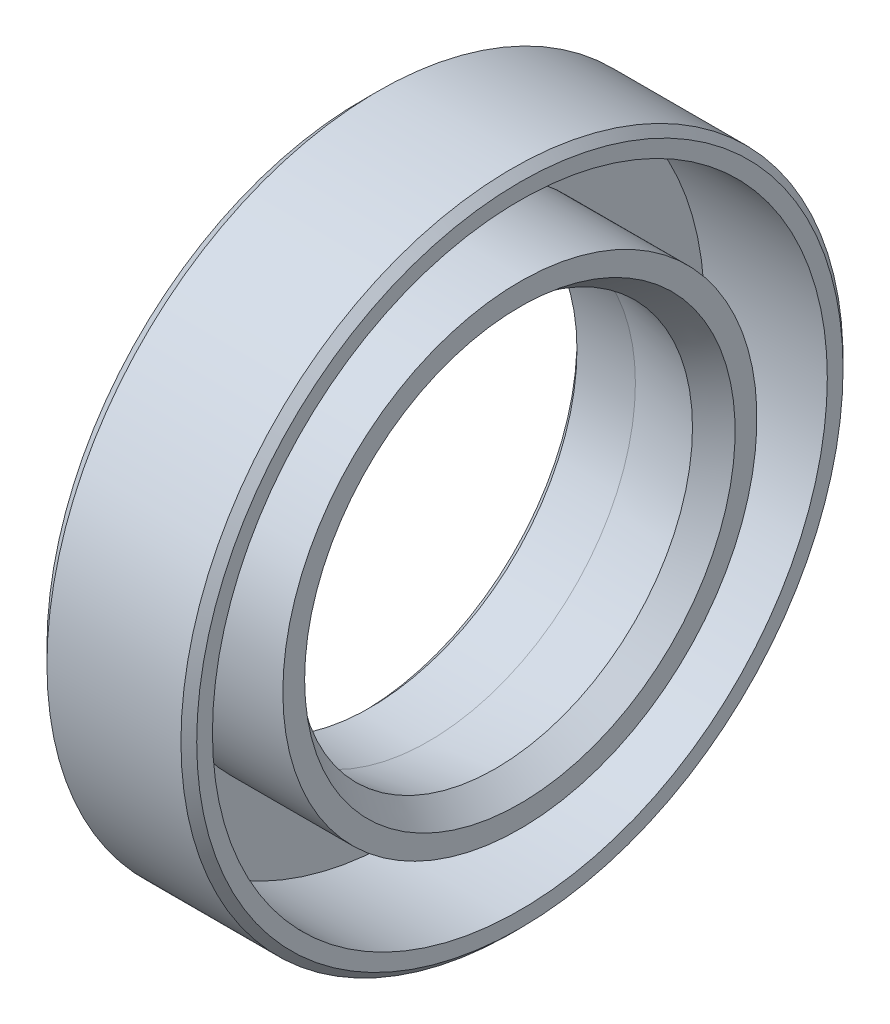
from build123d import *


with BuildPart() as part:
    # Sweep1: sweep along a path in Sketch2
    with BuildLine(Plane(origin=(3.448675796, 0, 0), x_dir=(0, 0, -1), z_dir=(1, 0, 0))) as sweep1_path:
        CenterArc((0, -16.75), 12.5, 0, 360)
    # Sketch1 → Sweep1 (sweep)
    with BuildSketch(Plane.XY):
        Polygon((5, -1.714269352), (5, -3.095213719), (3.448675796, -4.25), (-0.794073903, -3.628291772), (-4.5, -3.628291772), (-5, -3.128291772), (-5, 3.25), (-4, 4.25), (4.5, 4.25), (5, 3.75), (5, 2.751782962), (-2.803797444, 2.751782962), (-2.803797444, -1.714269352), align=None)
    sweep(path=sweep1_path.line)


solid = part.part
